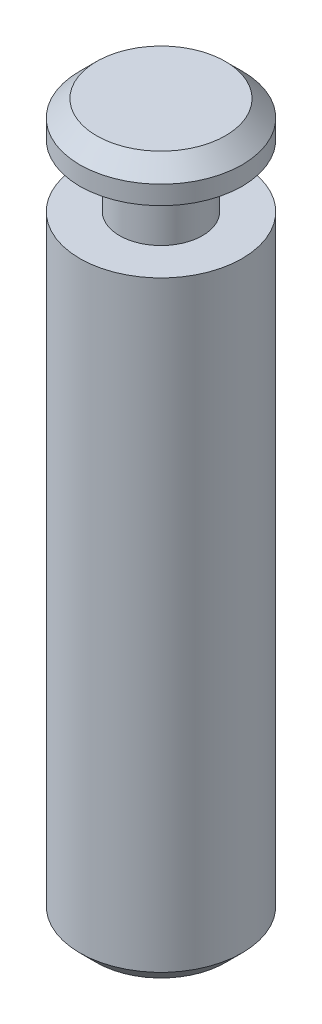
from build123d import *

# Parameters (mm, degrees)
SKETCH1_R           = 5.5372
BOSS_EXTRUDE1_DEPTH = 48.8442
CHAMFER1_SIZE       = 1.143
SKETCH2_W           = 9.8679
SKETCH2_H           = 4.2672


with BuildPart() as part:
    # Sketch1 → Boss-Extrude1 (new body)
    with BuildSketch(Plane(origin=(0, 0, 0), x_dir=(1, 0, 0), z_dir=(0, 1, 0))):
        with Locations(Location((0, 0, 0), (0, 0, 270))):
            Circle(SKETCH1_R)
    extrude(amount=BOSS_EXTRUDE1_DEPTH)

    # Chamfer1
    chamfer1_edges = [part.edges().sort_by_distance(p)[0] for p in [
        (0, 0, -5.5372),
        (0, 48.8442, -5.5372),
    ]]
    chamfer(chamfer1_edges, length=CHAMFER1_SIZE)

    # Sketch2 → Cut-Revolve1 (revolve, cut)
    with BuildSketch(Plane(origin=(0, 0, 0), x_dir=(0, 0, -1), z_dir=(1, 0, 0))):
        with Locations((7.76605, 44.2976)):
            Rectangle(SKETCH2_W, SKETCH2_H)
    revolve(axis=Axis((0, 0, 0), (0, 1, 0)), mode=Mode.SUBTRACT)


solid = part.part
